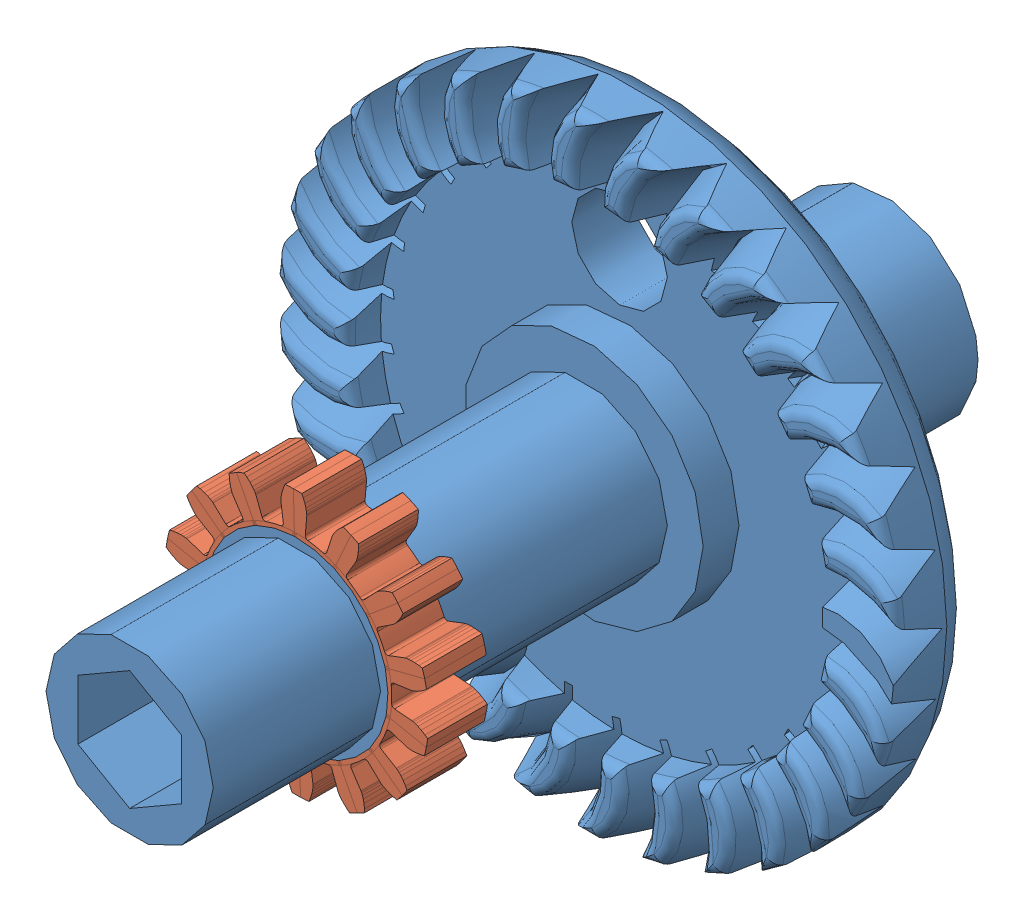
SolidWorks assembly Moulinet 1 eng.SLDASM, configuration Défaut (file format 11000). Lengths in mm.
Overall size (26.02 26.05 31.5).
2 component instances, 2 part files, 0 mates.
Components (placement in the parent):
- Moulinet 2-1: Moulinet 2.SLDPRT [Défaut] at (-72.2451 84.5643 -15.75) size (26.02 26.05 31.5)
- Engrenage 1-114-1: Engrenage 1-114.SLDPRT [Défaut] at (-78.8841 69.7708 6.25) x (0 0 1) z (-0.912338 0.409438 0) size (2.5 11.04 10.9)
